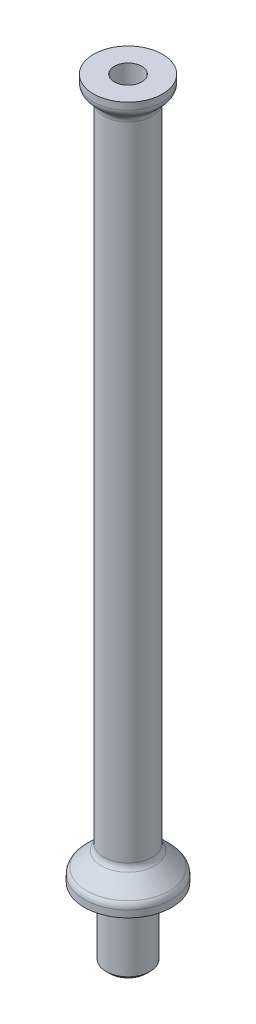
from build123d import *

# Parameters (mm, degrees)
F_7_16_20_TAPPED_HOLE1_D = 9.92124
FILLET2_R                = 0.127
FILLET3_R                = 3.175
CHAMFER1_SIZE            = 1.27


with BuildPart() as part:
    # Sketch1 → Revolve1 (revolve)
    with BuildSketch(Plane.XY, mode=Mode.PRIVATE) as revolve1_sk:
        Polygon((-7.9375, -25.4), (-7.9375, -1.905), (-6.90372, -1.905), (-6.90372, 0), (-15.875, 0), (-15.875, 3.81), (-8.7709375, 10.9140625), (-8.7709375, 246.4609375), (-12.5, 250.19), (-12.5, 254), (0, 254), (0, -25.4), align=None)
    revolve(revolve1_sk.sketch.rotate(Axis((0, 0, 0), (0, 1, 0)), 270), axis=Axis((0, 0, 0), (0, 1, 0)))

    # 7_16-20 Tapped Hole1 (through all)
    with Locations(Plane(origin=(0, 254, 0), x_dir=(1, 0, 0), z_dir=(0, 1, 0))):
        with Locations((0, 0)):
            Hole(F_7_16_20_TAPPED_HOLE1_D / 2)

    # Groove Sketch → O-Ring Groove (revolve, cut)
    with BuildSketch(Plane(origin=(0, 0, 0), x_dir=(0, -1, 0), z_dir=(0, 0, 1))):
        with BuildLine():
            Line((-2.1971, -8.5217), (0, -8.5217))
            Line((0, -8.5217), (0, -13.1445))
            Line((0, -13.1445), (-2.1971, -13.1445))
            ThreePointArc((-2.1971, -13.1445), (-2.511408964, -13.014308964), (-2.6416, -12.7))
            Line((-2.6416, -12.7), (-2.6416, -8.9662))
            ThreePointArc((-2.6416, -8.9662), (-2.511408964, -8.651891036), (-2.1971, -8.5217))
        make_face()
    revolve(axis=Axis((0, 0, 0), (0, 1, 0)), mode=Mode.SUBTRACT)

    # Fillet2
    fillet2_edges = [part.edges().sort_by_distance(p)[0] for p in [
        (8.5217, 0, 0),
        (13.1445, 0, 0),
    ]]
    fillet(fillet2_edges, radius=FILLET2_R)

    # Fillet3
    fillet3_edges = [part.edges().sort_by_distance(p)[0] for p in [
        (0, 3.81, 15.875),
        (0, 10.9140625, 8.7709375),
        (0, 246.4609375, 8.7709375),
        (0, 250.19, 12.5),
    ]]
    fillet(fillet3_edges, radius=FILLET3_R)

    # Chamfer1
    chamfer1_edges = [part.edges().sort_by_distance(p)[0] for p in [
        (0, -25.4, 7.9375),
    ]]
    chamfer(chamfer1_edges, length=CHAMFER1_SIZE)


solid = part.part
